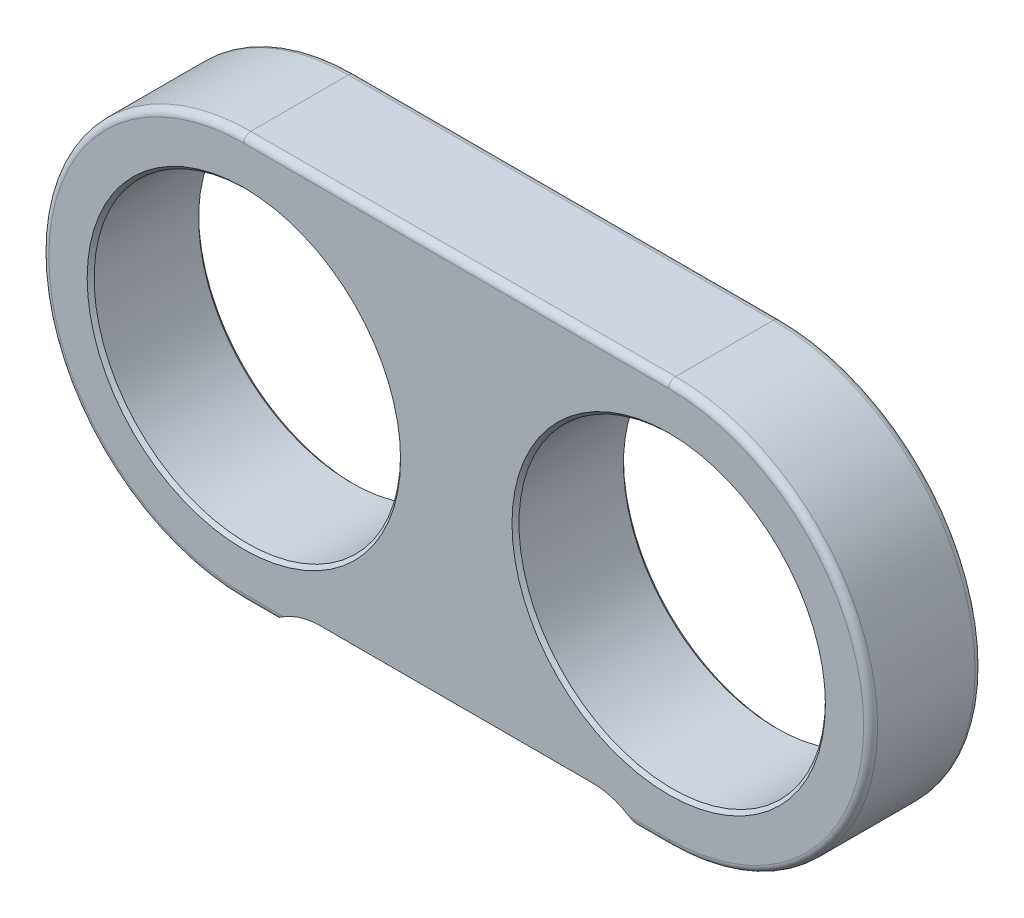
ISO-10303-21;
HEADER;
FILE_DESCRIPTION(('STEP AP214'),'2;1');
FILE_NAME('part.step','',(''),(''),'','','');
FILE_SCHEMA(('AUTOMOTIVE_DESIGN { 1 0 10303 214 1 1 1 1 }'));
ENDSEC;
DATA;
#1=APPLICATION_CONTEXT('core data for automotive mechanical design processes');
#2=APPLICATION_PROTOCOL_DEFINITION('international standard','automotive_design',2000,#1);
#3=PRODUCT_CONTEXT('',#1,'mechanical');
#4=PRODUCT('Part','Part','',(#3));
#5=PRODUCT_RELATED_PRODUCT_CATEGORY('part','',(#4));
#6=PRODUCT_DEFINITION_FORMATION('','',#4);
#7=PRODUCT_DEFINITION_CONTEXT('part definition',#1,'design');
#8=PRODUCT_DEFINITION('design','',#6,#7);
#9=PRODUCT_DEFINITION_SHAPE('','',#8);
#10=(LENGTH_UNIT() NAMED_UNIT(*) SI_UNIT(.MILLI.,.METRE.));
#11=(NAMED_UNIT(*) PLANE_ANGLE_UNIT() SI_UNIT($,.RADIAN.));
#12=(NAMED_UNIT(*) SI_UNIT($,.STERADIAN.) SOLID_ANGLE_UNIT());
#13=UNCERTAINTY_MEASURE_WITH_UNIT(LENGTH_MEASURE(1.E-05),#10,'distance_accuracy_value','');
#14=(GEOMETRIC_REPRESENTATION_CONTEXT(3) GLOBAL_UNCERTAINTY_ASSIGNED_CONTEXT((#13)) GLOBAL_UNIT_ASSIGNED_CONTEXT((#10,
#11,#12)) REPRESENTATION_CONTEXT('',''));
#15=CARTESIAN_POINT('',(0.,0.,0.));
#16=DIRECTION('',(0.,0.,1.));
#17=DIRECTION('',(1.,0.,0.));
#18=AXIS2_PLACEMENT_3D('',#15,#16,#17);
#19=CARTESIAN_POINT('',(0.,0.,16.));
#20=DIRECTION('',(0.,0.,1.));
#21=DIRECTION('',(1.,0.,0.));
#22=AXIS2_PLACEMENT_3D('',#19,#20,#21);
#23=PLANE('',#22);
#24=CARTESIAN_POINT('',(0.,0.,16.));
#25=DIRECTION('',(0.,0.,1.));
#26=DIRECTION('',(1.,0.,0.));
#27=AXIS2_PLACEMENT_3D('',#24,#25,#26);
#28=CIRCLE('',#27,22.5);
#29=CARTESIAN_POINT('',(22.5,0.,16.));
#30=VERTEX_POINT('',#29);
#31=EDGE_CURVE('E636',#30,#30,#28,.F.);
#32=ORIENTED_EDGE('',*,*,#31,.T.);
#33=EDGE_LOOP('',(#32));
#34=FACE_BOUND('',#33,.T.);
#35=CARTESIAN_POINT('',(61.,0.,16.));
#36=DIRECTION('',(0.,0.,1.));
#37=DIRECTION('',(1.,0.,0.));
#38=AXIS2_PLACEMENT_3D('',#35,#36,#37);
#39=CIRCLE('',#38,22.5);
#40=CARTESIAN_POINT('',(83.5,0.,16.));
#41=VERTEX_POINT('',#40);
#42=EDGE_CURVE('E633',#41,#41,#39,.F.);
#43=ORIENTED_EDGE('',*,*,#42,.T.);
#44=EDGE_LOOP('',(#43));
#45=FACE_BOUND('',#44,.T.);
#46=CARTESIAN_POINT('',(50.,-36.5,16.));
#47=DIRECTION('',(0.,0.,-1.));
#48=DIRECTION('',(1.,0.,0.));
#49=AXIS2_PLACEMENT_3D('',#46,#47,#48);
#50=CIRCLE('',#49,10.);
#51=CARTESIAN_POINT('',(50.,-26.5,16.));
#52=VERTEX_POINT('',#51);
#53=CARTESIAN_POINT('',(55.2678268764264,-28.,16.));
#54=VERTEX_POINT('',#53);
#55=EDGE_CURVE('E485',#52,#54,#50,.T.);
#56=ORIENTED_EDGE('',*,*,#55,.T.);
#57=DIRECTION('',(1.,0.,0.));
#58=VECTOR('',#57,1.);
#59=CARTESIAN_POINT('',(61.,-28.,16.));
#60=LINE('',#59,#58);
#61=CARTESIAN_POINT('',(61.,-28.,16.));
#62=VERTEX_POINT('',#61);
#63=EDGE_CURVE('E511',#54,#62,#60,.T.);
#64=ORIENTED_EDGE('',*,*,#63,.T.);
#65=CARTESIAN_POINT('',(61.,0.,16.));
#66=DIRECTION('',(0.,0.,1.));
#67=DIRECTION('',(1.,0.,0.));
#68=AXIS2_PLACEMENT_3D('',#65,#66,#67);
#69=CIRCLE('',#68,28.);
#70=CARTESIAN_POINT('',(61.,28.,16.));
#71=VERTEX_POINT('',#70);
#72=EDGE_CURVE('E507',#62,#71,#69,.T.);
#73=ORIENTED_EDGE('',*,*,#72,.T.);
#74=DIRECTION('',(-1.,0.,0.));
#75=VECTOR('',#74,1.);
#76=CARTESIAN_POINT('',(0.,28.,16.));
#77=LINE('',#76,#75);
#78=CARTESIAN_POINT('',(0.,28.,16.));
#79=VERTEX_POINT('',#78);
#80=EDGE_CURVE('E503',#71,#79,#77,.T.);
#81=ORIENTED_EDGE('',*,*,#80,.T.);
#82=CARTESIAN_POINT('',(0.,0.,16.));
#83=DIRECTION('',(0.,0.,1.));
#84=DIRECTION('',(1.,0.,0.));
#85=AXIS2_PLACEMENT_3D('',#82,#83,#84);
#86=CIRCLE('',#85,28.);
#87=CARTESIAN_POINT('',(0.,-28.,16.));
#88=VERTEX_POINT('',#87);
#89=EDGE_CURVE('E505',#79,#88,#86,.T.);
#90=ORIENTED_EDGE('',*,*,#89,.T.);
#91=DIRECTION('',(1.,0.,0.));
#92=VECTOR('',#91,1.);
#93=CARTESIAN_POINT('',(4.38562172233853,-28.,16.));
#94=LINE('',#93,#92);
#95=CARTESIAN_POINT('',(5.73217312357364,-28.,16.));
#96=VERTEX_POINT('',#95);
#97=EDGE_CURVE('E509',#88,#96,#94,.T.);
#98=ORIENTED_EDGE('',*,*,#97,.T.);
#99=CARTESIAN_POINT('',(11.,-36.5,16.));
#100=DIRECTION('',(0.,0.,-1.));
#101=DIRECTION('',(1.,0.,0.));
#102=AXIS2_PLACEMENT_3D('',#99,#100,#101);
#103=CIRCLE('',#102,10.);
#104=CARTESIAN_POINT('',(11.,-26.5,16.));
#105=VERTEX_POINT('',#104);
#106=EDGE_CURVE('E479',#96,#105,#103,.T.);
#107=ORIENTED_EDGE('',*,*,#106,.T.);
#108=DIRECTION('',(1.,0.,0.));
#109=VECTOR('',#108,1.);
#110=CARTESIAN_POINT('',(50.,-26.5,16.));
#111=LINE('',#110,#109);
#112=EDGE_CURVE('E470',#105,#52,#111,.T.);
#113=ORIENTED_EDGE('',*,*,#112,.T.);
#114=EDGE_LOOP('',(#56,#64,#73,#81,#90,#98,#107,#113));
#115=FACE_BOUND('',#114,.T.);
#116=ADVANCED_FACE('F348',(#34,#45,#115),#23,.T.);
#117=CARTESIAN_POINT('',(0.,0.,0.));
#118=DIRECTION('',(0.,0.,1.));
#119=DIRECTION('',(1.,0.,0.));
#120=AXIS2_PLACEMENT_3D('',#117,#118,#119);
#121=PLANE('',#120);
#122=CARTESIAN_POINT('',(0.,0.,0.));
#123=DIRECTION('',(0.,0.,1.));
#124=DIRECTION('',(1.,0.,0.));
#125=AXIS2_PLACEMENT_3D('',#122,#123,#124);
#126=CIRCLE('',#125,22.5);
#127=CARTESIAN_POINT('',(22.5,0.,0.));
#128=VERTEX_POINT('',#127);
#129=EDGE_CURVE('E642',#128,#128,#126,.T.);
#130=ORIENTED_EDGE('',*,*,#129,.T.);
#131=EDGE_LOOP('',(#130));
#132=FACE_BOUND('',#131,.T.);
#133=CARTESIAN_POINT('',(61.,0.,0.));
#134=DIRECTION('',(0.,0.,1.));
#135=DIRECTION('',(1.,0.,0.));
#136=AXIS2_PLACEMENT_3D('',#133,#134,#135);
#137=CIRCLE('',#136,22.5);
#138=CARTESIAN_POINT('',(83.5,0.,0.));
#139=VERTEX_POINT('',#138);
#140=EDGE_CURVE('E639',#139,#139,#137,.T.);
#141=ORIENTED_EDGE('',*,*,#140,.T.);
#142=EDGE_LOOP('',(#141));
#143=FACE_BOUND('',#142,.T.);
#144=CARTESIAN_POINT('',(61.,0.,0.));
#145=DIRECTION('',(0.,0.,1.));
#146=DIRECTION('',(1.,0.,0.));
#147=AXIS2_PLACEMENT_3D('',#144,#145,#146);
#148=CIRCLE('',#147,28.);
#149=CARTESIAN_POINT('',(61.,28.,0.));
#150=VERTEX_POINT('',#149);
#151=CARTESIAN_POINT('',(61.,-28.,0.));
#152=VERTEX_POINT('',#151);
#153=EDGE_CURVE('E715',#150,#152,#148,.F.);
#154=ORIENTED_EDGE('',*,*,#153,.T.);
#155=DIRECTION('',(1.,0.,0.));
#156=VECTOR('',#155,1.);
#157=CARTESIAN_POINT('',(0.,-28.,0.));
#158=LINE('',#157,#156);
#159=CARTESIAN_POINT('',(55.2678268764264,-28.,0.));
#160=VERTEX_POINT('',#159);
#161=EDGE_CURVE('E620',#152,#160,#158,.F.);
#162=ORIENTED_EDGE('',*,*,#161,.T.);
#163=CARTESIAN_POINT('',(50.,-36.5,0.));
#164=DIRECTION('',(0.,0.,-1.));
#165=DIRECTION('',(1.,0.,0.));
#166=AXIS2_PLACEMENT_3D('',#163,#164,#165);
#167=CIRCLE('',#166,10.);
#168=CARTESIAN_POINT('',(50.,-26.5,0.));
#169=VERTEX_POINT('',#168);
#170=EDGE_CURVE('E477',#169,#160,#167,.T.);
#171=ORIENTED_EDGE('',*,*,#170,.F.);
#172=DIRECTION('',(1.,0.,0.));
#173=VECTOR('',#172,1.);
#174=CARTESIAN_POINT('',(50.,-26.5,0.));
#175=LINE('',#174,#173);
#176=CARTESIAN_POINT('',(11.,-26.5,0.));
#177=VERTEX_POINT('',#176);
#178=EDGE_CURVE('E463',#177,#169,#175,.T.);
#179=ORIENTED_EDGE('',*,*,#178,.F.);
#180=CARTESIAN_POINT('',(11.,-36.5,0.));
#181=DIRECTION('',(0.,0.,-1.));
#182=DIRECTION('',(1.,0.,0.));
#183=AXIS2_PLACEMENT_3D('',#180,#181,#182);
#184=CIRCLE('',#183,10.);
#185=CARTESIAN_POINT('',(5.73217312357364,-28.,0.));
#186=VERTEX_POINT('',#185);
#187=EDGE_CURVE('E451',#186,#177,#184,.T.);
#188=ORIENTED_EDGE('',*,*,#187,.F.);
#189=DIRECTION('',(1.,0.,0.));
#190=VECTOR('',#189,1.);
#191=CARTESIAN_POINT('',(0.,-28.,0.));
#192=LINE('',#191,#190);
#193=CARTESIAN_POINT('',(0.,-28.,0.));
#194=VERTEX_POINT('',#193);
#195=EDGE_CURVE('E738',#186,#194,#192,.F.);
#196=ORIENTED_EDGE('',*,*,#195,.T.);
#197=CARTESIAN_POINT('',(0.,0.,0.));
#198=DIRECTION('',(0.,0.,1.));
#199=DIRECTION('',(1.,0.,0.));
#200=AXIS2_PLACEMENT_3D('',#197,#198,#199);
#201=CIRCLE('',#200,28.);
#202=CARTESIAN_POINT('',(0.,28.,0.));
#203=VERTEX_POINT('',#202);
#204=EDGE_CURVE('E725',#194,#203,#201,.F.);
#205=ORIENTED_EDGE('',*,*,#204,.T.);
#206=DIRECTION('',(-1.,0.,0.));
#207=VECTOR('',#206,1.);
#208=CARTESIAN_POINT('',(0.,28.,0.));
#209=LINE('',#208,#207);
#210=EDGE_CURVE('E719',#203,#150,#209,.F.);
#211=ORIENTED_EDGE('',*,*,#210,.T.);
#212=EDGE_LOOP('',(#154,#162,#171,#179,#188,#196,#205,#211));
#213=FACE_BOUND('',#212,.T.);
#214=ADVANCED_FACE('F475',(#132,#143,#213),#121,.F.);
#215=CARTESIAN_POINT('',(0.,0.,16.));
#216=DIRECTION('',(0.,0.,-1.));
#217=DIRECTION('',(-1.,0.,0.));
#218=AXIS2_PLACEMENT_3D('',#215,#216,#217);
#219=CYLINDRICAL_SURFACE('',#218,29.);
#220=DIRECTION('',(0.,0.,-1.));
#221=VECTOR('',#220,1.);
#222=CARTESIAN_POINT('',(0.,-29.,16.));
#223=LINE('',#222,#221);
#224=CARTESIAN_POINT('',(0.,-29.,15.));
#225=VERTEX_POINT('',#224);
#226=CARTESIAN_POINT('',(0.,-29.,1.));
#227=VERTEX_POINT('',#226);
#228=EDGE_CURVE('E500',#225,#227,#223,.T.);
#229=ORIENTED_EDGE('',*,*,#228,.F.);
#230=CARTESIAN_POINT('',(0.,0.,15.));
#231=DIRECTION('',(0.,0.,1.));
#232=DIRECTION('',(1.,0.,0.));
#233=AXIS2_PLACEMENT_3D('',#230,#231,#232);
#234=CIRCLE('',#233,29.);
#235=CARTESIAN_POINT('',(0.,29.,15.));
#236=VERTEX_POINT('',#235);
#237=EDGE_CURVE('E370',#225,#236,#234,.F.);
#238=ORIENTED_EDGE('',*,*,#237,.T.);
#239=DIRECTION('',(0.,0.,-1.));
#240=VECTOR('',#239,1.);
#241=CARTESIAN_POINT('',(0.,29.,16.));
#242=LINE('',#241,#240);
#243=CARTESIAN_POINT('',(0.,29.,1.));
#244=VERTEX_POINT('',#243);
#245=EDGE_CURVE('E488',#236,#244,#242,.T.);
#246=ORIENTED_EDGE('',*,*,#245,.T.);
#247=CARTESIAN_POINT('',(0.,0.,1.));
#248=DIRECTION('',(0.,0.,1.));
#249=DIRECTION('',(1.,0.,0.));
#250=AXIS2_PLACEMENT_3D('',#247,#248,#249);
#251=CIRCLE('',#250,29.);
#252=EDGE_CURVE('E617',#244,#227,#251,.T.);
#253=ORIENTED_EDGE('',*,*,#252,.T.);
#254=EDGE_LOOP('',(#229,#238,#246,#253));
#255=FACE_BOUND('',#254,.T.);
#256=ADVANCED_FACE('F350',(#255),#219,.T.);
#257=CARTESIAN_POINT('',(0.,-29.,16.));
#258=DIRECTION('',(0.,1.,0.));
#259=DIRECTION('',(0.,0.,1.));
#260=AXIS2_PLACEMENT_3D('',#257,#258,#259);
#261=PLANE('',#260);
#262=DIRECTION('',(0.,0.,-1.));
#263=VECTOR('',#262,1.);
#264=CARTESIAN_POINT('',(4.38562172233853,-29.,16.));
#265=LINE('',#264,#263);
#266=CARTESIAN_POINT('',(4.38562172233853,-29.,15.));
#267=VERTEX_POINT('',#266);
#268=CARTESIAN_POINT('',(4.38562172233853,-29.,1.));
#269=VERTEX_POINT('',#268);
#270=EDGE_CURVE('E471',#267,#269,#265,.T.);
#271=ORIENTED_EDGE('',*,*,#270,.F.);
#272=DIRECTION('',(1.,0.,0.));
#273=VECTOR('',#272,1.);
#274=CARTESIAN_POINT('',(0.,-29.,15.));
#275=LINE('',#274,#273);
#276=EDGE_CURVE('E731',#267,#225,#275,.F.);
#277=ORIENTED_EDGE('',*,*,#276,.T.);
#278=ORIENTED_EDGE('',*,*,#228,.T.);
#279=DIRECTION('',(1.,0.,0.));
#280=VECTOR('',#279,1.);
#281=CARTESIAN_POINT('',(0.,-29.,1.));
#282=LINE('',#281,#280);
#283=EDGE_CURVE('E562',#227,#269,#282,.T.);
#284=ORIENTED_EDGE('',*,*,#283,.T.);
#285=EDGE_LOOP('',(#271,#277,#278,#284));
#286=FACE_BOUND('',#285,.T.);
#287=ADVANCED_FACE('F549',(#286),#261,.F.);
#288=CARTESIAN_POINT('',(11.,-36.5,16.));
#289=DIRECTION('',(0.,0.,-1.));
#290=DIRECTION('',(-1.,0.,0.));
#291=AXIS2_PLACEMENT_3D('',#288,#289,#290);
#292=CYLINDRICAL_SURFACE('',#291,10.);
#293=ORIENTED_EDGE('',*,*,#106,.F.);
#294=CARTESIAN_POINT('',(5.73217312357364,-28.,16.));
#295=CARTESIAN_POINT('',(5.67291985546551,-28.0367156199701,15.9999790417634));
#296=CARTESIAN_POINT('',(5.61402398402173,-28.0740795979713,15.9979749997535));
#297=CARTESIAN_POINT('',(5.49707307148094,-28.1499914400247,15.9894334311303));
#298=CARTESIAN_POINT('',(5.43902131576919,-28.1885427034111,15.9828814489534));
#299=CARTESIAN_POINT('',(5.32348284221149,-28.2670114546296,15.9645452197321));
#300=CARTESIAN_POINT('',(5.26601469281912,-28.3069404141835,15.9526906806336));
#301=CARTESIAN_POINT('',(5.15302637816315,-28.3871897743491,15.9229914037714));
#302=CARTESIAN_POINT('',(5.09750353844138,-28.4275095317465,15.9051552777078));
#303=CARTESIAN_POINT('',(4.98664911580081,-28.5097201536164,15.8616510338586));
#304=CARTESIAN_POINT('',(4.93142916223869,-28.5516037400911,15.8356781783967));
#305=CARTESIAN_POINT('',(4.8250384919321,-28.633975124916,15.7750368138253));
#306=CARTESIAN_POINT('',(4.77385558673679,-28.6744668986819,15.7403959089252));
#307=CARTESIAN_POINT('',(4.68636272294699,-28.7449679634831,15.6686168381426));
#308=CARTESIAN_POINT('',(4.64907556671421,-28.7755061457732,15.6332069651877));
#309=CARTESIAN_POINT('',(4.57962495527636,-28.8331355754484,15.5551834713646));
#310=CARTESIAN_POINT('',(4.54745562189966,-28.860230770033,15.512578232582));
#311=CARTESIAN_POINT('',(4.49772300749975,-28.9025550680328,15.432290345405));
#312=CARTESIAN_POINT('',(4.47854503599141,-28.9190291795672,15.3962718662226));
#313=CARTESIAN_POINT('',(4.44496144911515,-28.9480491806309,15.3206789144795));
#314=CARTESIAN_POINT('',(4.43054335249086,-28.9606053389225,15.2811140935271));
#315=CARTESIAN_POINT('',(4.40815348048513,-28.9801749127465,15.2019814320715));
#316=CARTESIAN_POINT('',(4.39980345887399,-28.9875127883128,15.1626047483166));
#317=CARTESIAN_POINT('',(4.39134696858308,-28.994953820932,15.102387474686));
#318=CARTESIAN_POINT('',(4.38920591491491,-28.9968401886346,15.08202737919));
#319=CARTESIAN_POINT('',(4.38634149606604,-28.9993651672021,15.0411155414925));
#320=CARTESIAN_POINT('',(4.38561921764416,-29.0000028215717,15.0205636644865));
#321=CARTESIAN_POINT('',(4.38562172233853,-29.,15.));
#322=B_SPLINE_CURVE_WITH_KNOTS('',3,(#294,#295,#296,#297,#298,#299,#300,#301,#302,#303,#304,
#305,#306,#307,#308,#309,#310,#311,#312,#313,#314,#315,#316,#317,#318,#319,#320,#321),
.UNSPECIFIED.,.F.,.F.,(4,2,2,2,2,2,2,2,2,2,2,2,2,4),(0.,0.209144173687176,0.418956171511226,
0.631635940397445,0.844010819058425,1.06554956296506,1.28639158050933,1.46522742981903,
1.64385636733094,1.77538506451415,1.90656607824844,2.02863385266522,2.09023280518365,
2.15187892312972),.UNSPECIFIED.);
#323=EDGE_CURVE('E556',#96,#267,#322,.T.);
#324=ORIENTED_EDGE('',*,*,#323,.T.);
#325=ORIENTED_EDGE('',*,*,#270,.T.);
#326=CARTESIAN_POINT('',(4.38562172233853,-29.,1.));
#327=CARTESIAN_POINT('',(4.38561895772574,-29.00000314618,0.978691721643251));
#328=CARTESIAN_POINT('',(4.38639464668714,-28.9993182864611,0.957397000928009));
#329=CARTESIAN_POINT('',(4.38946909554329,-28.9966082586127,0.915020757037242));
#330=CARTESIAN_POINT('',(4.39176661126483,-28.994584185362,0.893939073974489));
#331=CARTESIAN_POINT('',(4.40083332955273,-28.986607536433,0.831650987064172));
#332=CARTESIAN_POINT('',(4.40977824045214,-28.9787489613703,0.790976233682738));
#333=CARTESIAN_POINT('',(4.43281314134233,-28.958628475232,0.712466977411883));
#334=CARTESIAN_POINT('',(4.44688812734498,-28.9463794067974,0.674624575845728));
#335=CARTESIAN_POINT('',(4.47939205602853,-28.9183026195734,0.602215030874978));
#336=CARTESIAN_POINT('',(4.49783122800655,-28.9024664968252,0.56765585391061));
#337=CARTESIAN_POINT('',(4.54681868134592,-28.8607680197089,0.488283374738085));
#338=CARTESIAN_POINT('',(4.57918629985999,-28.8335015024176,0.445335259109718));
#339=CARTESIAN_POINT('',(4.6491170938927,-28.7754697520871,0.366720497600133));
#340=CARTESIAN_POINT('',(4.68668820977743,-28.7446991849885,0.331065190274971));
#341=CARTESIAN_POINT('',(4.78572038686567,-28.6649162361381,0.249948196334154));
#342=CARTESIAN_POINT('',(4.84959896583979,-28.6145985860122,0.208748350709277));
#343=CARTESIAN_POINT('',(4.98300748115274,-28.512325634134,0.13896779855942));
#344=CARTESIAN_POINT('',(5.05256422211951,-28.4603633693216,0.110451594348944));
#345=CARTESIAN_POINT('',(5.17255774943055,-28.3732202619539,0.0714532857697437));
#346=CARTESIAN_POINT('',(5.22204644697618,-28.3379539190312,0.0581199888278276));
#347=CARTESIAN_POINT('',(5.32235608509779,-28.267861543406,0.0358402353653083));
#348=CARTESIAN_POINT('',(5.37317794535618,-28.2330358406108,0.0268968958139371));
#349=CARTESIAN_POINT('',(5.47499228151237,-28.1646542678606,0.013041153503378));
#350=CARTESIAN_POINT('',(5.5259688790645,-28.1310869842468,0.00806625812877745));
#351=CARTESIAN_POINT('',(5.6285952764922,-28.0648503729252,0.00155473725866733));
#352=CARTESIAN_POINT('',(5.68024373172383,-28.0321795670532,1.20681857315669E-05));
#353=CARTESIAN_POINT('',(5.73217312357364,-28.,0.));
#354=B_SPLINE_CURVE_WITH_KNOTS('',3,(#326,#327,#328,#329,#330,#331,#332,#333,#334,#335,#336,
#337,#338,#339,#340,#341,#342,#343,#344,#345,#346,#347,#348,#349,#350,#351,#352,#353),
.UNSPECIFIED.,.F.,.F.,(4,2,2,2,2,2,2,2,2,2,2,2,2,4),(0.,0.0638741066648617,0.127696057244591,
0.254084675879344,0.380106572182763,0.506426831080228,0.686307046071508,0.866464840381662,
1.13842947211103,1.41176178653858,1.59823563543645,1.78484169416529,1.96844774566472,
2.15173024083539),.UNSPECIFIED.);
#355=EDGE_CURVE('E459',#269,#186,#354,.T.);
#356=ORIENTED_EDGE('',*,*,#355,.T.);
#357=ORIENTED_EDGE('',*,*,#187,.T.);
#358=DIRECTION('',(0.,0.,-1.));
#359=VECTOR('',#358,1.);
#360=CARTESIAN_POINT('',(11.,-26.5,16.));
#361=LINE('',#360,#359);
#362=EDGE_CURVE('E455',#105,#177,#361,.T.);
#363=ORIENTED_EDGE('',*,*,#362,.F.);
#364=EDGE_LOOP('',(#293,#324,#325,#356,#357,#363));
#365=FACE_BOUND('',#364,.T.);
#366=ADVANCED_FACE('F454',(#365),#292,.F.);
#367=CARTESIAN_POINT('',(50.,-26.5,16.));
#368=DIRECTION('',(0.,1.,0.));
#369=DIRECTION('',(-1.,0.,0.));
#370=AXIS2_PLACEMENT_3D('',#367,#368,#369);
#371=PLANE('',#370);
#372=ORIENTED_EDGE('',*,*,#178,.T.);
#373=DIRECTION('',(0.,0.,-1.));
#374=VECTOR('',#373,1.);
#375=CARTESIAN_POINT('',(50.,-26.5,16.));
#376=LINE('',#375,#374);
#377=EDGE_CURVE('E472',#52,#169,#376,.T.);
#378=ORIENTED_EDGE('',*,*,#377,.F.);
#379=ORIENTED_EDGE('',*,*,#112,.F.);
#380=ORIENTED_EDGE('',*,*,#362,.T.);
#381=EDGE_LOOP('',(#372,#378,#379,#380));
#382=FACE_BOUND('',#381,.T.);
#383=ADVANCED_FACE('F467',(#382),#371,.F.);
#384=CARTESIAN_POINT('',(50.,-36.5,16.));
#385=DIRECTION('',(0.,0.,-1.));
#386=DIRECTION('',(-1.,0.,0.));
#387=AXIS2_PLACEMENT_3D('',#384,#385,#386);
#388=CYLINDRICAL_SURFACE('',#387,10.);
#389=DIRECTION('',(0.,0.,-1.));
#390=VECTOR('',#389,1.);
#391=CARTESIAN_POINT('',(56.6143782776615,-29.,16.));
#392=LINE('',#391,#390);
#393=CARTESIAN_POINT('',(56.6143782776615,-29.,15.));
#394=VERTEX_POINT('',#393);
#395=CARTESIAN_POINT('',(56.6143782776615,-29.,1.));
#396=VERTEX_POINT('',#395);
#397=EDGE_CURVE('E495',#394,#396,#392,.T.);
#398=ORIENTED_EDGE('',*,*,#397,.F.);
#399=CARTESIAN_POINT('',(56.6143782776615,-29.,15.));
#400=CARTESIAN_POINT('',(56.6143810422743,-29.00000314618,15.0213082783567));
#401=CARTESIAN_POINT('',(56.6136053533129,-28.9993182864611,15.042602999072));
#402=CARTESIAN_POINT('',(56.6105309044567,-28.9966082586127,15.0849792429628));
#403=CARTESIAN_POINT('',(56.6082333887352,-28.994584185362,15.1060609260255));
#404=CARTESIAN_POINT('',(56.5991666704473,-28.986607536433,15.1683490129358));
#405=CARTESIAN_POINT('',(56.5902217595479,-28.9787489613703,15.2090237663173));
#406=CARTESIAN_POINT('',(56.5671868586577,-28.958628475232,15.2875330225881));
#407=CARTESIAN_POINT('',(56.553111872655,-28.9463794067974,15.3253754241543));
#408=CARTESIAN_POINT('',(56.5206079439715,-28.9183026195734,15.397784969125));
#409=CARTESIAN_POINT('',(56.5021687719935,-28.9024664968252,15.4323441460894));
#410=CARTESIAN_POINT('',(56.4531813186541,-28.8607680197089,15.5117166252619));
#411=CARTESIAN_POINT('',(56.42081370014,-28.8335015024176,15.5546647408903));
#412=CARTESIAN_POINT('',(56.3508829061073,-28.7754697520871,15.6332795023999));
#413=CARTESIAN_POINT('',(56.3133117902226,-28.7446991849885,15.668934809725));
#414=CARTESIAN_POINT('',(56.2142796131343,-28.6649162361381,15.7500518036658));
#415=CARTESIAN_POINT('',(56.1504010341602,-28.6145985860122,15.7912516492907));
#416=CARTESIAN_POINT('',(56.0169925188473,-28.512325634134,15.8610322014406));
#417=CARTESIAN_POINT('',(55.9474357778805,-28.4603633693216,15.8895484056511));
#418=CARTESIAN_POINT('',(55.8274422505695,-28.3732202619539,15.9285467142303));
#419=CARTESIAN_POINT('',(55.7779535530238,-28.3379539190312,15.9418800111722));
#420=CARTESIAN_POINT('',(55.6776439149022,-28.267861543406,15.9641597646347));
#421=CARTESIAN_POINT('',(55.6268220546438,-28.2330358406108,15.9731031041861));
#422=CARTESIAN_POINT('',(55.5250077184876,-28.1646542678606,15.9869588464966));
#423=CARTESIAN_POINT('',(55.4740311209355,-28.1310869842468,15.9919337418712));
#424=CARTESIAN_POINT('',(55.3714047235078,-28.0648503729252,15.9984452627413));
#425=CARTESIAN_POINT('',(55.3197562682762,-28.0321795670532,15.9999879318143));
#426=CARTESIAN_POINT('',(55.2678268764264,-28.,16.));
#427=B_SPLINE_CURVE_WITH_KNOTS('',3,(#399,#400,#401,#402,#403,#404,#405,#406,#407,#408,#409,
#410,#411,#412,#413,#414,#415,#416,#417,#418,#419,#420,#421,#422,#423,#424,#425,#426),
.UNSPECIFIED.,.F.,.F.,(4,2,2,2,2,2,2,2,2,2,2,2,2,4),(0.,0.06387410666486,0.127696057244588,
0.254084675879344,0.380106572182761,0.506426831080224,0.686307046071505,0.866464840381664,
1.13842947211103,1.41176178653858,1.59823563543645,1.78484169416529,1.96844774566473,
2.15173024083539),.UNSPECIFIED.);
#428=EDGE_CURVE('E526',#394,#54,#427,.T.);
#429=ORIENTED_EDGE('',*,*,#428,.T.);
#430=ORIENTED_EDGE('',*,*,#55,.F.);
#431=ORIENTED_EDGE('',*,*,#377,.T.);
#432=ORIENTED_EDGE('',*,*,#170,.T.);
#433=CARTESIAN_POINT('',(55.2678268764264,-28.,0.));
#434=CARTESIAN_POINT('',(55.3270801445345,-28.0367156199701,2.09582366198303E-05));
#435=CARTESIAN_POINT('',(55.3859760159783,-28.0740795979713,0.00202500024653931));
#436=CARTESIAN_POINT('',(55.5029269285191,-28.1499914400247,0.0105665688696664));
#437=CARTESIAN_POINT('',(55.5609786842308,-28.1885427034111,0.0171185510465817));
#438=CARTESIAN_POINT('',(55.6765171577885,-28.2670114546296,0.0354547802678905));
#439=CARTESIAN_POINT('',(55.7339853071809,-28.3069404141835,0.0473093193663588));
#440=CARTESIAN_POINT('',(55.8469736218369,-28.3871897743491,0.0770085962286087));
#441=CARTESIAN_POINT('',(55.9024964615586,-28.4275095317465,0.0948447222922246));
#442=CARTESIAN_POINT('',(56.0133508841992,-28.5097201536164,0.13834896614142));
#443=CARTESIAN_POINT('',(56.0685708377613,-28.5516037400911,0.16432182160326));
#444=CARTESIAN_POINT('',(56.1749615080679,-28.633975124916,0.224963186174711));
#445=CARTESIAN_POINT('',(56.2261444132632,-28.6744668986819,0.259604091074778));
#446=CARTESIAN_POINT('',(56.313637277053,-28.7449679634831,0.3313831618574));
#447=CARTESIAN_POINT('',(56.3509244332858,-28.7755061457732,0.366793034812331));
#448=CARTESIAN_POINT('',(56.4203750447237,-28.8331355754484,0.444816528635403));
#449=CARTESIAN_POINT('',(56.4525443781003,-28.860230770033,0.48742176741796));
#450=CARTESIAN_POINT('',(56.5022769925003,-28.9025550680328,0.56770965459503));
#451=CARTESIAN_POINT('',(56.5214549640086,-28.9190291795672,0.603728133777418));
#452=CARTESIAN_POINT('',(56.5550385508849,-28.9480491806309,0.67932108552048));
#453=CARTESIAN_POINT('',(56.5694566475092,-28.9606053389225,0.718885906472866));
#454=CARTESIAN_POINT('',(56.5918465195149,-28.9801749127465,0.798018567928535));
#455=CARTESIAN_POINT('',(56.600196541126,-28.9875127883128,0.837395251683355));
#456=CARTESIAN_POINT('',(56.6086530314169,-28.994953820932,0.897612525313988));
#457=CARTESIAN_POINT('',(56.6107940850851,-28.9968401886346,0.917972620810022));
#458=CARTESIAN_POINT('',(56.613658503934,-28.9993651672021,0.958884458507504));
#459=CARTESIAN_POINT('',(56.6143807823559,-29.0000028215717,0.979436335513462));
#460=CARTESIAN_POINT('',(56.6143782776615,-29.,1.));
#461=B_SPLINE_CURVE_WITH_KNOTS('',3,(#433,#434,#435,#436,#437,#438,#439,#440,#441,#442,#443,
#444,#445,#446,#447,#448,#449,#450,#451,#452,#453,#454,#455,#456,#457,#458,#459,#460),
.UNSPECIFIED.,.F.,.F.,(4,2,2,2,2,2,2,2,2,2,2,2,2,4),(0.,0.209144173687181,0.418956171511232,
0.631635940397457,0.844010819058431,1.06554956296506,1.28639158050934,1.46522742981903,
1.64385636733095,1.77538506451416,1.90656607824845,2.02863385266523,2.09023280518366,
2.15187892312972),.UNSPECIFIED.);
#462=EDGE_CURVE('E519',#160,#396,#461,.T.);
#463=ORIENTED_EDGE('',*,*,#462,.T.);
#464=EDGE_LOOP('',(#398,#429,#430,#431,#432,#463));
#465=FACE_BOUND('',#464,.T.);
#466=ADVANCED_FACE('F536',(#465),#388,.F.);
#467=CARTESIAN_POINT('',(56.6143782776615,-29.,16.));
#468=DIRECTION('',(0.,1.,0.));
#469=DIRECTION('',(0.,0.,1.));
#470=AXIS2_PLACEMENT_3D('',#467,#468,#469);
#471=PLANE('',#470);
#472=DIRECTION('',(0.,0.,-1.));
#473=VECTOR('',#472,1.);
#474=CARTESIAN_POINT('',(61.,-29.,16.));
#475=LINE('',#474,#473);
#476=CARTESIAN_POINT('',(61.,-29.,15.));
#477=VERTEX_POINT('',#476);
#478=CARTESIAN_POINT('',(61.,-29.,1.));
#479=VERTEX_POINT('',#478);
#480=EDGE_CURVE('E492',#477,#479,#475,.T.);
#481=ORIENTED_EDGE('',*,*,#480,.F.);
#482=DIRECTION('',(1.,0.,0.));
#483=VECTOR('',#482,1.);
#484=CARTESIAN_POINT('',(56.6143782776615,-29.,15.));
#485=LINE('',#484,#483);
#486=EDGE_CURVE('E517',#477,#394,#485,.F.);
#487=ORIENTED_EDGE('',*,*,#486,.T.);
#488=ORIENTED_EDGE('',*,*,#397,.T.);
#489=DIRECTION('',(1.,0.,0.));
#490=VECTOR('',#489,1.);
#491=CARTESIAN_POINT('',(56.6143782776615,-29.,1.));
#492=LINE('',#491,#490);
#493=EDGE_CURVE('E514',#396,#479,#492,.T.);
#494=ORIENTED_EDGE('',*,*,#493,.T.);
#495=EDGE_LOOP('',(#481,#487,#488,#494));
#496=FACE_BOUND('',#495,.T.);
#497=ADVANCED_FACE('F541',(#496),#471,.F.);
#498=CARTESIAN_POINT('',(61.,0.,16.));
#499=DIRECTION('',(0.,0.,-1.));
#500=DIRECTION('',(-1.,0.,0.));
#501=AXIS2_PLACEMENT_3D('',#498,#499,#500);
#502=CYLINDRICAL_SURFACE('',#501,29.);
#503=DIRECTION('',(0.,0.,-1.));
#504=VECTOR('',#503,1.);
#505=CARTESIAN_POINT('',(61.,29.,16.));
#506=LINE('',#505,#504);
#507=CARTESIAN_POINT('',(61.,29.,15.));
#508=VERTEX_POINT('',#507);
#509=CARTESIAN_POINT('',(61.,29.,1.));
#510=VERTEX_POINT('',#509);
#511=EDGE_CURVE('E490',#508,#510,#506,.T.);
#512=ORIENTED_EDGE('',*,*,#511,.F.);
#513=CARTESIAN_POINT('',(61.,0.,15.));
#514=DIRECTION('',(0.,0.,1.));
#515=DIRECTION('',(1.,0.,0.));
#516=AXIS2_PLACEMENT_3D('',#513,#514,#515);
#517=CIRCLE('',#516,29.);
#518=EDGE_CURVE('E598',#508,#477,#517,.F.);
#519=ORIENTED_EDGE('',*,*,#518,.T.);
#520=ORIENTED_EDGE('',*,*,#480,.T.);
#521=CARTESIAN_POINT('',(61.,0.,1.));
#522=DIRECTION('',(0.,0.,1.));
#523=DIRECTION('',(1.,0.,0.));
#524=AXIS2_PLACEMENT_3D('',#521,#522,#523);
#525=CIRCLE('',#524,29.);
#526=EDGE_CURVE('E601',#479,#510,#525,.T.);
#527=ORIENTED_EDGE('',*,*,#526,.T.);
#528=EDGE_LOOP('',(#512,#519,#520,#527));
#529=FACE_BOUND('',#528,.T.);
#530=ADVANCED_FACE('F588',(#529),#502,.T.);
#531=CARTESIAN_POINT('',(0.,29.,16.));
#532=DIRECTION('',(0.,-1.,0.));
#533=DIRECTION('',(0.,0.,-1.));
#534=AXIS2_PLACEMENT_3D('',#531,#532,#533);
#535=PLANE('',#534);
#536=ORIENTED_EDGE('',*,*,#245,.F.);
#537=DIRECTION('',(-1.,0.,0.));
#538=VECTOR('',#537,1.);
#539=CARTESIAN_POINT('',(61.,29.,15.));
#540=LINE('',#539,#538);
#541=EDGE_CURVE('E609',#236,#508,#540,.F.);
#542=ORIENTED_EDGE('',*,*,#541,.T.);
#543=ORIENTED_EDGE('',*,*,#511,.T.);
#544=DIRECTION('',(-1.,0.,0.));
#545=VECTOR('',#544,1.);
#546=CARTESIAN_POINT('',(0.,29.,1.));
#547=LINE('',#546,#545);
#548=EDGE_CURVE('E363',#510,#244,#547,.T.);
#549=ORIENTED_EDGE('',*,*,#548,.T.);
#550=EDGE_LOOP('',(#536,#542,#543,#549));
#551=FACE_BOUND('',#550,.T.);
#552=ADVANCED_FACE('F579',(#551),#535,.F.);
#553=CARTESIAN_POINT('',(0.,0.,16.));
#554=DIRECTION('',(0.,0.,-1.));
#555=DIRECTION('',(-1.,0.,0.));
#556=AXIS2_PLACEMENT_3D('',#553,#554,#555);
#557=CYLINDRICAL_SURFACE('',#556,22.);
#558=CARTESIAN_POINT('',(0.,0.,15.5));
#559=DIRECTION('',(0.,0.,1.));
#560=DIRECTION('',(1.,0.,0.));
#561=AXIS2_PLACEMENT_3D('',#558,#559,#560);
#562=CIRCLE('',#561,22.);
#563=CARTESIAN_POINT('',(22.,0.,15.5));
#564=VERTEX_POINT('',#563);
#565=EDGE_CURVE('E630',#564,#564,#562,.T.);
#566=ORIENTED_EDGE('',*,*,#565,.T.);
#567=EDGE_LOOP('',(#566));
#568=FACE_BOUND('',#567,.T.);
#569=CARTESIAN_POINT('',(0.,0.,0.500000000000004));
#570=DIRECTION('',(0.,0.,1.));
#571=DIRECTION('',(1.,0.,0.));
#572=AXIS2_PLACEMENT_3D('',#569,#570,#571);
#573=CIRCLE('',#572,22.);
#574=CARTESIAN_POINT('',(22.,0.,0.500000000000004));
#575=VERTEX_POINT('',#574);
#576=EDGE_CURVE('E627',#575,#575,#573,.F.);
#577=ORIENTED_EDGE('',*,*,#576,.T.);
#578=EDGE_LOOP('',(#577));
#579=FACE_BOUND('',#578,.T.);
#580=ADVANCED_FACE('F575',(#568,#579),#557,.F.);
#581=CARTESIAN_POINT('',(61.,0.,16.));
#582=DIRECTION('',(0.,0.,-1.));
#583=DIRECTION('',(-1.,0.,0.));
#584=AXIS2_PLACEMENT_3D('',#581,#582,#583);
#585=CYLINDRICAL_SURFACE('',#584,22.);
#586=CARTESIAN_POINT('',(61.,0.,15.5));
#587=DIRECTION('',(0.,0.,1.));
#588=DIRECTION('',(1.,0.,0.));
#589=AXIS2_PLACEMENT_3D('',#586,#587,#588);
#590=CIRCLE('',#589,22.);
#591=CARTESIAN_POINT('',(83.,0.,15.5));
#592=VERTEX_POINT('',#591);
#593=EDGE_CURVE('E11',#592,#592,#590,.T.);
#594=ORIENTED_EDGE('',*,*,#593,.T.);
#595=EDGE_LOOP('',(#594));
#596=FACE_BOUND('',#595,.T.);
#597=CARTESIAN_POINT('',(61.,0.,0.5));
#598=DIRECTION('',(0.,0.,1.));
#599=DIRECTION('',(1.,0.,0.));
#600=AXIS2_PLACEMENT_3D('',#597,#598,#599);
#601=CIRCLE('',#600,22.);
#602=CARTESIAN_POINT('',(83.,0.,0.5));
#603=VERTEX_POINT('',#602);
#604=EDGE_CURVE('E356',#603,#603,#601,.F.);
#605=ORIENTED_EDGE('',*,*,#604,.T.);
#606=EDGE_LOOP('',(#605));
#607=FACE_BOUND('',#606,.T.);
#608=ADVANCED_FACE('F570',(#596,#607),#585,.F.);
#609=CARTESIAN_POINT('',(0.,-28.,15.));
#610=DIRECTION('',(-1.,0.,0.));
#611=DIRECTION('',(0.,0.,1.));
#612=AXIS2_PLACEMENT_3D('',#609,#610,#611);
#613=CYLINDRICAL_SURFACE('',#612,1.);
#614=ORIENTED_EDGE('',*,*,#323,.F.);
#615=ORIENTED_EDGE('',*,*,#97,.F.);
#616=CARTESIAN_POINT('',(0.,-28.,15.));
#617=DIRECTION('',(-1.,0.,0.));
#618=DIRECTION('',(0.,0.,1.));
#619=AXIS2_PLACEMENT_3D('',#616,#617,#618);
#620=CIRCLE('',#619,1.);
#621=EDGE_CURVE('E464',#225,#88,#620,.T.);
#622=ORIENTED_EDGE('',*,*,#621,.F.);
#623=ORIENTED_EDGE('',*,*,#276,.F.);
#624=EDGE_LOOP('',(#614,#615,#622,#623));
#625=FACE_BOUND('',#624,.T.);
#626=ADVANCED_FACE('F564',(#625),#613,.T.);
#627=CARTESIAN_POINT('',(0.,0.,15.));
#628=DIRECTION('',(0.,0.,1.));
#629=DIRECTION('',(1.,0.,0.));
#630=AXIS2_PLACEMENT_3D('',#627,#628,#629);
#631=TOROIDAL_SURFACE('',#630,28.,1.);
#632=ORIENTED_EDGE('',*,*,#621,.T.);
#633=ORIENTED_EDGE('',*,*,#89,.F.);
#634=CARTESIAN_POINT('',(0.,28.,15.));
#635=DIRECTION('',(1.,0.,0.));
#636=DIRECTION('',(0.,0.,-1.));
#637=AXIS2_PLACEMENT_3D('',#634,#635,#636);
#638=CIRCLE('',#637,1.);
#639=EDGE_CURVE('E612',#236,#79,#638,.T.);
#640=ORIENTED_EDGE('',*,*,#639,.F.);
#641=ORIENTED_EDGE('',*,*,#237,.F.);
#642=EDGE_LOOP('',(#632,#633,#640,#641));
#643=FACE_BOUND('',#642,.T.);
#644=ADVANCED_FACE('F569',(#643),#631,.T.);
#645=CARTESIAN_POINT('',(0.,28.,15.));
#646=DIRECTION('',(1.,0.,0.));
#647=DIRECTION('',(0.,0.,-1.));
#648=AXIS2_PLACEMENT_3D('',#645,#646,#647);
#649=CYLINDRICAL_SURFACE('',#648,1.);
#650=ORIENTED_EDGE('',*,*,#639,.T.);
#651=ORIENTED_EDGE('',*,*,#80,.F.);
#652=CARTESIAN_POINT('',(61.,28.,15.));
#653=DIRECTION('',(1.,0.,0.));
#654=DIRECTION('',(0.,0.,-1.));
#655=AXIS2_PLACEMENT_3D('',#652,#653,#654);
#656=CIRCLE('',#655,1.);
#657=EDGE_CURVE('E606',#508,#71,#656,.T.);
#658=ORIENTED_EDGE('',*,*,#657,.F.);
#659=ORIENTED_EDGE('',*,*,#541,.F.);
#660=EDGE_LOOP('',(#650,#651,#658,#659));
#661=FACE_BOUND('',#660,.T.);
#662=ADVANCED_FACE('F608',(#661),#649,.T.);
#663=CARTESIAN_POINT('',(61.,0.,15.));
#664=DIRECTION('',(0.,0.,1.));
#665=DIRECTION('',(1.,0.,0.));
#666=AXIS2_PLACEMENT_3D('',#663,#664,#665);
#667=TOROIDAL_SURFACE('',#666,28.,1.);
#668=ORIENTED_EDGE('',*,*,#657,.T.);
#669=ORIENTED_EDGE('',*,*,#72,.F.);
#670=CARTESIAN_POINT('',(61.,-28.,15.));
#671=DIRECTION('',(-1.,0.,0.));
#672=DIRECTION('',(0.,0.,1.));
#673=AXIS2_PLACEMENT_3D('',#670,#671,#672);
#674=CIRCLE('',#673,1.);
#675=EDGE_CURVE('E613',#477,#62,#674,.T.);
#676=ORIENTED_EDGE('',*,*,#675,.F.);
#677=ORIENTED_EDGE('',*,*,#518,.F.);
#678=EDGE_LOOP('',(#668,#669,#676,#677));
#679=FACE_BOUND('',#678,.T.);
#680=ADVANCED_FACE('F616',(#679),#667,.T.);
#681=CARTESIAN_POINT('',(0.,-28.,15.));
#682=DIRECTION('',(-1.,0.,0.));
#683=DIRECTION('',(0.,0.,1.));
#684=AXIS2_PLACEMENT_3D('',#681,#682,#683);
#685=CYLINDRICAL_SURFACE('',#684,1.);
#686=ORIENTED_EDGE('',*,*,#428,.F.);
#687=ORIENTED_EDGE('',*,*,#486,.F.);
#688=ORIENTED_EDGE('',*,*,#675,.T.);
#689=ORIENTED_EDGE('',*,*,#63,.F.);
#690=EDGE_LOOP('',(#686,#687,#688,#689));
#691=FACE_BOUND('',#690,.T.);
#692=ADVANCED_FACE('F686',(#691),#685,.T.);
#693=CARTESIAN_POINT('',(0.,-28.,1.));
#694=DIRECTION('',(1.,0.,0.));
#695=DIRECTION('',(0.,0.,-1.));
#696=AXIS2_PLACEMENT_3D('',#693,#694,#695);
#697=CYLINDRICAL_SURFACE('',#696,1.);
#698=ORIENTED_EDGE('',*,*,#355,.F.);
#699=ORIENTED_EDGE('',*,*,#283,.F.);
#700=CARTESIAN_POINT('',(0.,-28.,1.));
#701=DIRECTION('',(-1.,0.,0.));
#702=DIRECTION('',(0.,0.,1.));
#703=AXIS2_PLACEMENT_3D('',#700,#701,#702);
#704=CIRCLE('',#703,1.);
#705=EDGE_CURVE('E688',#194,#227,#704,.T.);
#706=ORIENTED_EDGE('',*,*,#705,.F.);
#707=ORIENTED_EDGE('',*,*,#195,.F.);
#708=EDGE_LOOP('',(#698,#699,#706,#707));
#709=FACE_BOUND('',#708,.T.);
#710=ADVANCED_FACE('F733',(#709),#697,.T.);
#711=CARTESIAN_POINT('',(0.,0.,1.));
#712=DIRECTION('',(0.,0.,1.));
#713=DIRECTION('',(1.,0.,0.));
#714=AXIS2_PLACEMENT_3D('',#711,#712,#713);
#715=TOROIDAL_SURFACE('',#714,28.,1.);
#716=ORIENTED_EDGE('',*,*,#705,.T.);
#717=ORIENTED_EDGE('',*,*,#252,.F.);
#718=CARTESIAN_POINT('',(0.,28.,1.));
#719=DIRECTION('',(1.,0.,0.));
#720=DIRECTION('',(0.,0.,-1.));
#721=AXIS2_PLACEMENT_3D('',#718,#719,#720);
#722=CIRCLE('',#721,1.);
#723=EDGE_CURVE('E700',#203,#244,#722,.T.);
#724=ORIENTED_EDGE('',*,*,#723,.F.);
#725=ORIENTED_EDGE('',*,*,#204,.F.);
#726=EDGE_LOOP('',(#716,#717,#724,#725));
#727=FACE_BOUND('',#726,.T.);
#728=ADVANCED_FACE('F724',(#727),#715,.T.);
#729=CARTESIAN_POINT('',(0.,28.,1.));
#730=DIRECTION('',(-1.,0.,0.));
#731=DIRECTION('',(0.,0.,1.));
#732=AXIS2_PLACEMENT_3D('',#729,#730,#731);
#733=CYLINDRICAL_SURFACE('',#732,1.);
#734=ORIENTED_EDGE('',*,*,#723,.T.);
#735=ORIENTED_EDGE('',*,*,#548,.F.);
#736=CARTESIAN_POINT('',(61.,28.,1.));
#737=DIRECTION('',(1.,0.,0.));
#738=DIRECTION('',(0.,0.,-1.));
#739=AXIS2_PLACEMENT_3D('',#736,#737,#738);
#740=CIRCLE('',#739,1.);
#741=EDGE_CURVE('E703',#150,#510,#740,.T.);
#742=ORIENTED_EDGE('',*,*,#741,.F.);
#743=ORIENTED_EDGE('',*,*,#210,.F.);
#744=EDGE_LOOP('',(#734,#735,#742,#743));
#745=FACE_BOUND('',#744,.T.);
#746=ADVANCED_FACE('F718',(#745),#733,.T.);
#747=CARTESIAN_POINT('',(61.,0.,1.));
#748=DIRECTION('',(0.,0.,1.));
#749=DIRECTION('',(1.,0.,0.));
#750=AXIS2_PLACEMENT_3D('',#747,#748,#749);
#751=TOROIDAL_SURFACE('',#750,28.,1.);
#752=ORIENTED_EDGE('',*,*,#741,.T.);
#753=ORIENTED_EDGE('',*,*,#526,.F.);
#754=CARTESIAN_POINT('',(61.,-28.,1.));
#755=DIRECTION('',(-1.,0.,0.));
#756=DIRECTION('',(0.,0.,1.));
#757=AXIS2_PLACEMENT_3D('',#754,#755,#756);
#758=CIRCLE('',#757,1.);
#759=EDGE_CURVE('E706',#152,#479,#758,.T.);
#760=ORIENTED_EDGE('',*,*,#759,.F.);
#761=ORIENTED_EDGE('',*,*,#153,.F.);
#762=EDGE_LOOP('',(#752,#753,#760,#761));
#763=FACE_BOUND('',#762,.T.);
#764=ADVANCED_FACE('F670',(#763),#751,.T.);
#765=CARTESIAN_POINT('',(56.6143782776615,-28.,1.));
#766=DIRECTION('',(1.,0.,0.));
#767=DIRECTION('',(0.,0.,-1.));
#768=AXIS2_PLACEMENT_3D('',#765,#766,#767);
#769=CYLINDRICAL_SURFACE('',#768,1.);
#770=ORIENTED_EDGE('',*,*,#462,.F.);
#771=ORIENTED_EDGE('',*,*,#161,.F.);
#772=ORIENTED_EDGE('',*,*,#759,.T.);
#773=ORIENTED_EDGE('',*,*,#493,.F.);
#774=EDGE_LOOP('',(#770,#771,#772,#773));
#775=FACE_BOUND('',#774,.T.);
#776=ADVANCED_FACE('F532',(#775),#769,.T.);
#777=CARTESIAN_POINT('',(0.,0.,15.5));
#778=DIRECTION('',(0.,0.,1.));
#779=DIRECTION('',(1.,0.,0.));
#780=AXIS2_PLACEMENT_3D('',#777,#778,#779);
#781=CONICAL_SURFACE('',#780,22.,0.785398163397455);
#782=ORIENTED_EDGE('',*,*,#31,.F.);
#783=EDGE_LOOP('',(#782));
#784=FACE_BOUND('',#783,.T.);
#785=ORIENTED_EDGE('',*,*,#565,.F.);
#786=EDGE_LOOP('',(#785));
#787=FACE_BOUND('',#786,.T.);
#788=ADVANCED_FACE('F663',(#784,#787),#781,.F.);
#789=CARTESIAN_POINT('',(0.,0.,0.));
#790=DIRECTION('',(0.,0.,-1.));
#791=DIRECTION('',(-1.,0.,0.));
#792=AXIS2_PLACEMENT_3D('',#789,#790,#791);
#793=CONICAL_SURFACE('',#792,22.5,0.785398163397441);
#794=ORIENTED_EDGE('',*,*,#576,.F.);
#795=EDGE_LOOP('',(#794));
#796=FACE_BOUND('',#795,.T.);
#797=ORIENTED_EDGE('',*,*,#129,.F.);
#798=EDGE_LOOP('',(#797));
#799=FACE_BOUND('',#798,.T.);
#800=ADVANCED_FACE('F658',(#796,#799),#793,.F.);
#801=CARTESIAN_POINT('',(61.,0.,15.5));
#802=DIRECTION('',(0.,0.,1.));
#803=DIRECTION('',(1.,0.,0.));
#804=AXIS2_PLACEMENT_3D('',#801,#802,#803);
#805=CONICAL_SURFACE('',#804,22.,0.785398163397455);
#806=ORIENTED_EDGE('',*,*,#42,.F.);
#807=EDGE_LOOP('',(#806));
#808=FACE_BOUND('',#807,.T.);
#809=ORIENTED_EDGE('',*,*,#593,.F.);
#810=EDGE_LOOP('',(#809));
#811=FACE_BOUND('',#810,.T.);
#812=ADVANCED_FACE('F651',(#808,#811),#805,.F.);
#813=CARTESIAN_POINT('',(61.,0.,0.));
#814=DIRECTION('',(0.,0.,-1.));
#815=DIRECTION('',(-1.,0.,0.));
#816=AXIS2_PLACEMENT_3D('',#813,#814,#815);
#817=CONICAL_SURFACE('',#816,22.5,0.785398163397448);
#818=ORIENTED_EDGE('',*,*,#604,.F.);
#819=EDGE_LOOP('',(#818));
#820=FACE_BOUND('',#819,.T.);
#821=ORIENTED_EDGE('',*,*,#140,.F.);
#822=EDGE_LOOP('',(#821));
#823=FACE_BOUND('',#822,.T.);
#824=ADVANCED_FACE('F648',(#820,#823),#817,.F.);
#825=CLOSED_SHELL('',(#116,#214,#256,#287,#366,#383,#466,#497,#530,#552,#580,#608,#626,#644,
#662,#680,#692,#710,#728,#746,#764,#776,#788,#800,#812,#824));
#826=MANIFOLD_SOLID_BREP('B2',#825);
#827=ADVANCED_BREP_SHAPE_REPRESENTATION('',(#18,#826),#14);
#828=SHAPE_DEFINITION_REPRESENTATION(#9,#827);
ENDSEC;
END-ISO-10303-21;
